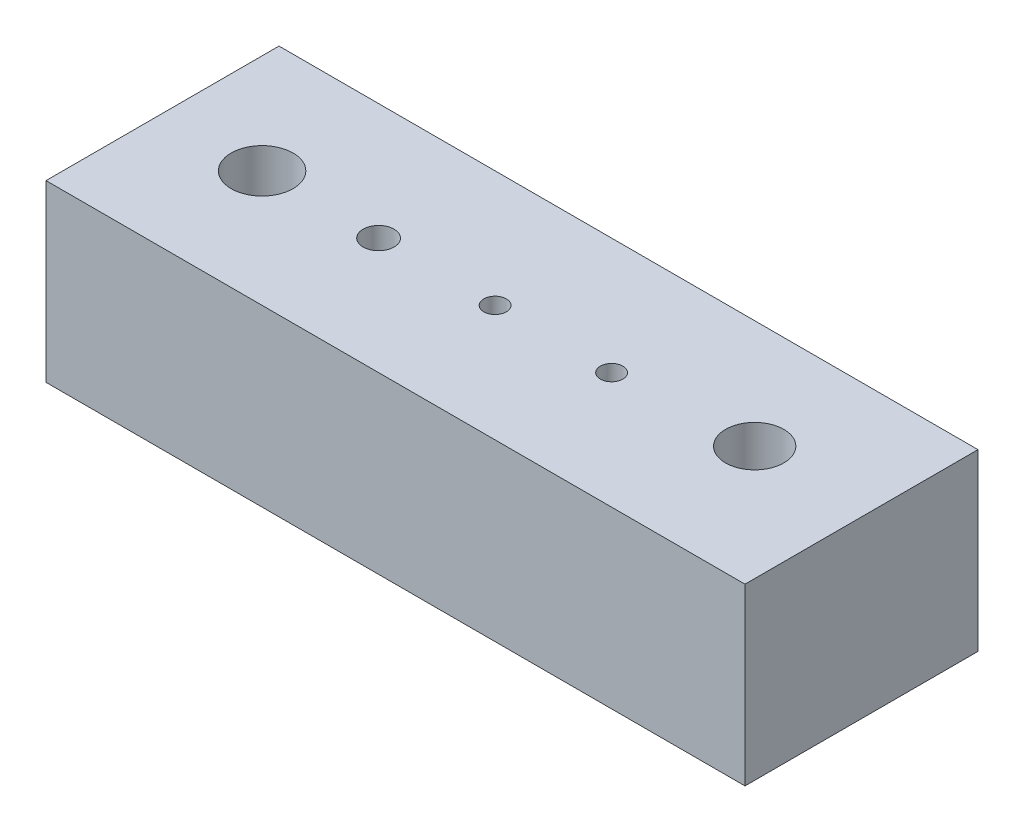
from build123d import *

# Parameters (mm, degrees)
SKETCH1_W                        = 152.4
SKETCH1_H                        = 50.8
BOSS_EXTRUDE1_DEPTH              = 38.1
F_1_2_CLEARANCE_HOLE2_D          = 13.49248
F_1_4_CLEARANCE_HOLE1_D          = 6.7564
F_1_4_CLEARANCE_HOLE1_DEPTH      = 38.1
F_1_4_CLEARANCE_HOLE1_TIP        = 2.029827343
F_10_0_1935_DIAMETER_HOLE1_D     = 4.9149
F_10_0_1935_DIAMETER_HOLE1_DEPTH = 38.1
F_10_0_1935_DIAMETER_HOLE1_TIP   = 1.476584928
F_10_0_1935_DIAMETER_HOLE2_D     = 4.9149
F_10_0_1935_DIAMETER_HOLE2_DEPTH = 38.1
F_10_0_1935_DIAMETER_HOLE2_TIP   = 1.476584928
F_1_2_0_5_DIAMETER_HOLE1_D       = 12.7
F_1_2_0_5_DIAMETER_HOLE1_DEPTH   = 38.1
F_1_2_0_5_DIAMETER_HOLE1_TIP     = 3.815464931


with BuildPart() as part:
    # Sketch1 → Boss-Extrude1 (new body)
    with BuildSketch(Plane(origin=(0, 0, 0), x_dir=(1, 0, 0), z_dir=(0, 1, 0))):
        with Locations((76.2, 25.4)):
            Rectangle(SKETCH1_W, SKETCH1_H)
    extrude(amount=BOSS_EXTRUDE1_DEPTH)

    # 1_2 Clearance Hole2 (through all)
    with Locations(Plane(origin=(0, 38.1, 0), x_dir=(1, 0, 0), z_dir=(0, 1, 0))):
        with Locations((21.717, 25.4)):
            Hole(F_1_2_CLEARANCE_HOLE2_D / 2)

    # 1_4 Clearance Hole1
    with Locations(Plane(origin=(0, 38.1, 0), x_dir=(1, 0, 0), z_dir=(0, 1, 0))):
        with Locations((47.117, 25.4)):
            Hole(F_1_4_CLEARANCE_HOLE1_D / 2, depth=F_1_4_CLEARANCE_HOLE1_DEPTH)
            with Locations((0, 0, -(F_1_4_CLEARANCE_HOLE1_DEPTH + F_1_4_CLEARANCE_HOLE1_TIP / 2))):  # 118° drill point
                Cone(0, F_1_4_CLEARANCE_HOLE1_D / 2, F_1_4_CLEARANCE_HOLE1_TIP, mode=Mode.SUBTRACT)

    # 10 _0.1935_ Diameter Hole1
    with Locations(Plane(origin=(0, 38.1, 0), x_dir=(1, 0, 0), z_dir=(0, 1, 0))):
        with Locations((72.517, 25.4)):
            Hole(F_10_0_1935_DIAMETER_HOLE1_D / 2, depth=F_10_0_1935_DIAMETER_HOLE1_DEPTH)
            with Locations((0, 0, -(F_10_0_1935_DIAMETER_HOLE1_DEPTH + F_10_0_1935_DIAMETER_HOLE1_TIP / 2))):  # 118° drill point
                Cone(0, F_10_0_1935_DIAMETER_HOLE1_D / 2, F_10_0_1935_DIAMETER_HOLE1_TIP, mode=Mode.SUBTRACT)

    # 10 _0.1935_ Diameter Hole2
    with Locations(Plane(origin=(0, 38.1, 0), x_dir=(1, 0, 0), z_dir=(0, 1, 0))):
        with Locations((97.917, 25.4)):
            Hole(F_10_0_1935_DIAMETER_HOLE2_D / 2, depth=F_10_0_1935_DIAMETER_HOLE2_DEPTH)
            with Locations((0, 0, -(F_10_0_1935_DIAMETER_HOLE2_DEPTH + F_10_0_1935_DIAMETER_HOLE2_TIP / 2))):  # 118° drill point
                Cone(0, F_10_0_1935_DIAMETER_HOLE2_D / 2, F_10_0_1935_DIAMETER_HOLE2_TIP, mode=Mode.SUBTRACT)

    # 1_2 _0.5_ Diameter Hole1
    with Locations(Plane(origin=(0, 38.1, 0), x_dir=(1, 0, 0), z_dir=(0, 1, 0))):
        with Locations((127.399862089, 27.114215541)):
            Hole(F_1_2_0_5_DIAMETER_HOLE1_D / 2, depth=F_1_2_0_5_DIAMETER_HOLE1_DEPTH)
            with Locations((0, 0, -(F_1_2_0_5_DIAMETER_HOLE1_DEPTH + F_1_2_0_5_DIAMETER_HOLE1_TIP / 2))):  # 118° drill point
                Cone(0, F_1_2_0_5_DIAMETER_HOLE1_D / 2, F_1_2_0_5_DIAMETER_HOLE1_TIP, mode=Mode.SUBTRACT)


solid = part.part
